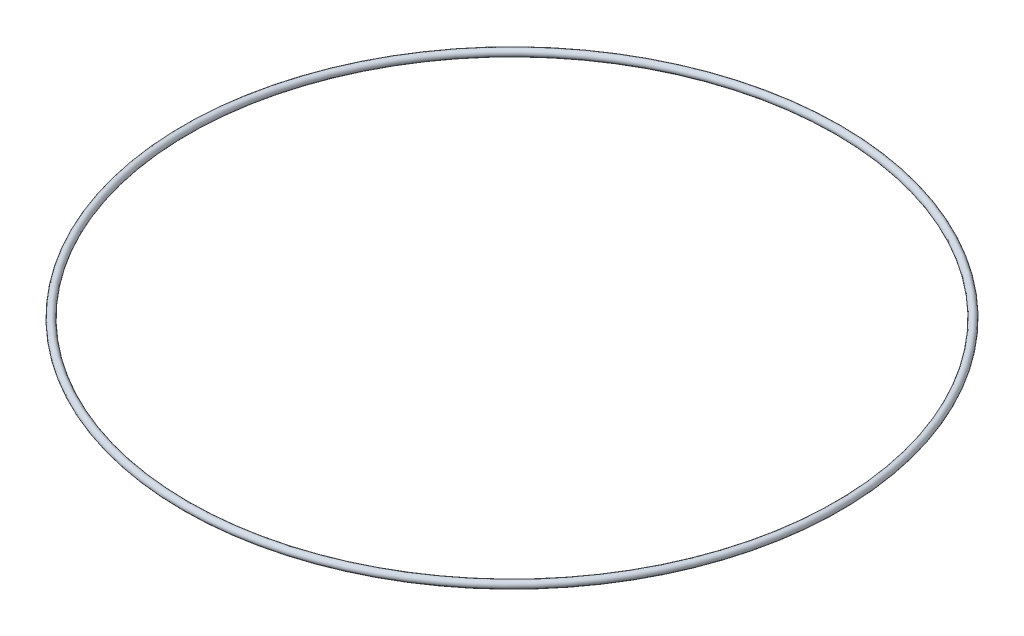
from build123d import *

# Parameters (mm, degrees)
ESQUISSE1_R = 1.5


with BuildPart() as part:
    # Esquisse1 → Base-R_volution (revolve)
    with BuildSketch(Plane.XY, mode=Mode.PRIVATE) as base_r_volution_sk:
        with Locations((136.5, 0)):
            Circle(ESQUISSE1_R)
    revolve(base_r_volution_sk.sketch.rotate(Axis((0, 1.5, 0), (0, -1, 0)), 90), axis=Axis((0, 1.5, 0), (0, -1, 0)))


solid = part.part
